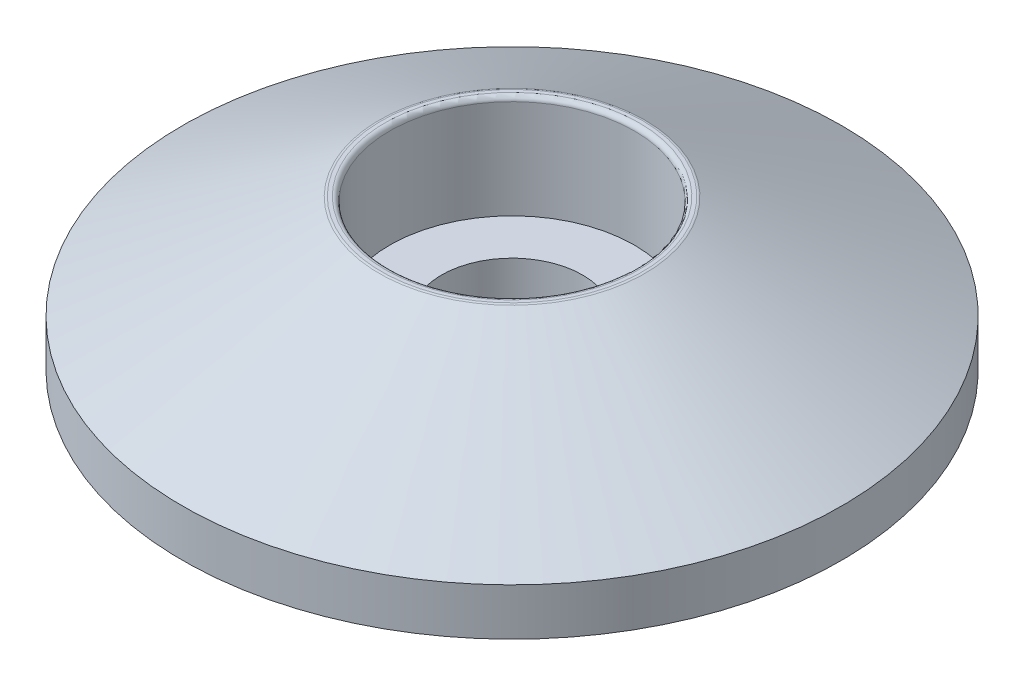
ISO-10303-21;
HEADER;
FILE_DESCRIPTION(('STEP AP214'),'2;1');
FILE_NAME('part.step','',(''),(''),'','','');
FILE_SCHEMA(('AUTOMOTIVE_DESIGN { 1 0 10303 214 1 1 1 1 }'));
ENDSEC;
DATA;
#1=APPLICATION_CONTEXT('core data for automotive mechanical design processes');
#2=APPLICATION_PROTOCOL_DEFINITION('international standard','automotive_design',2000,#1);
#3=PRODUCT_CONTEXT('',#1,'mechanical');
#4=PRODUCT('Part','Part','',(#3));
#5=PRODUCT_RELATED_PRODUCT_CATEGORY('part','',(#4));
#6=PRODUCT_DEFINITION_FORMATION('','',#4);
#7=PRODUCT_DEFINITION_CONTEXT('part definition',#1,'design');
#8=PRODUCT_DEFINITION('design','',#6,#7);
#9=PRODUCT_DEFINITION_SHAPE('','',#8);
#10=(LENGTH_UNIT() NAMED_UNIT(*) SI_UNIT(.MILLI.,.METRE.));
#11=(NAMED_UNIT(*) PLANE_ANGLE_UNIT() SI_UNIT($,.RADIAN.));
#12=(NAMED_UNIT(*) SI_UNIT($,.STERADIAN.) SOLID_ANGLE_UNIT());
#13=UNCERTAINTY_MEASURE_WITH_UNIT(LENGTH_MEASURE(1.E-05),#10,'distance_accuracy_value','');
#14=(GEOMETRIC_REPRESENTATION_CONTEXT(3) GLOBAL_UNCERTAINTY_ASSIGNED_CONTEXT((#13)) GLOBAL_UNIT_ASSIGNED_CONTEXT((#10,
#11,#12)) REPRESENTATION_CONTEXT('',''));
#15=CARTESIAN_POINT('',(0.,0.,0.));
#16=DIRECTION('',(0.,0.,1.));
#17=DIRECTION('',(1.,0.,0.));
#18=AXIS2_PLACEMENT_3D('',#15,#16,#17);
#19=CARTESIAN_POINT('',(0.,-13.0955737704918,0.));
#20=DIRECTION('',(0.,-1.,0.));
#21=DIRECTION('',(0.,0.,-1.));
#22=AXIS2_PLACEMENT_3D('',#19,#20,#21);
#23=CYLINDRICAL_SURFACE('',#22,7.);
#24=CARTESIAN_POINT('',(0.,1.,0.));
#25=DIRECTION('',(0.,-1.,0.));
#26=DIRECTION('',(0.,0.,-1.));
#27=AXIS2_PLACEMENT_3D('',#24,#25,#26);
#28=CIRCLE('',#27,7.);
#29=CARTESIAN_POINT('',(0.,1.,-7.));
#30=VERTEX_POINT('',#29);
#31=EDGE_CURVE('E55',#30,#30,#28,.T.);
#32=ORIENTED_EDGE('',*,*,#31,.T.);
#33=EDGE_LOOP('',(#32));
#34=FACE_BOUND('',#33,.T.);
#35=CARTESIAN_POINT('',(0.,0.,0.));
#36=DIRECTION('',(0.,-1.,0.));
#37=DIRECTION('',(0.,0.,-1.));
#38=AXIS2_PLACEMENT_3D('',#35,#36,#37);
#39=CIRCLE('',#38,7.);
#40=CARTESIAN_POINT('',(0.,0.,-7.));
#41=VERTEX_POINT('',#40);
#42=EDGE_CURVE('E10',#41,#41,#39,.T.);
#43=ORIENTED_EDGE('',*,*,#42,.F.);
#44=EDGE_LOOP('',(#43));
#45=FACE_BOUND('',#44,.T.);
#46=ADVANCED_FACE('F24',(#34,#45),#23,.T.);
#47=CARTESIAN_POINT('',(7.,0.,0.));
#48=DIRECTION('',(0.,-1.,0.));
#49=DIRECTION('',(0.,0.,-1.));
#50=AXIS2_PLACEMENT_3D('',#47,#48,#49);
#51=PLANE('',#50);
#52=ORIENTED_EDGE('',*,*,#42,.T.);
#53=EDGE_LOOP('',(#52));
#54=FACE_BOUND('',#53,.T.);
#55=CARTESIAN_POINT('',(0.,0.,0.));
#56=DIRECTION('',(0.,-1.,0.));
#57=DIRECTION('',(0.,0.,-1.));
#58=AXIS2_PLACEMENT_3D('',#55,#56,#57);
#59=CIRCLE('',#58,1.5);
#60=CARTESIAN_POINT('',(0.,0.,-1.5));
#61=VERTEX_POINT('',#60);
#62=EDGE_CURVE('E30',#61,#61,#59,.T.);
#63=ORIENTED_EDGE('',*,*,#62,.F.);
#64=EDGE_LOOP('',(#63));
#65=FACE_BOUND('',#64,.T.);
#66=ADVANCED_FACE('F73',(#54,#65),#51,.T.);
#67=CARTESIAN_POINT('',(0.,-13.0955737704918,0.));
#68=DIRECTION('',(0.,-1.,0.));
#69=DIRECTION('',(0.,0.,-1.));
#70=AXIS2_PLACEMENT_3D('',#67,#68,#69);
#71=CYLINDRICAL_SURFACE('',#70,1.5);
#72=ORIENTED_EDGE('',*,*,#62,.T.);
#73=EDGE_LOOP('',(#72));
#74=FACE_BOUND('',#73,.T.);
#75=CARTESIAN_POINT('',(0.,1.,0.));
#76=DIRECTION('',(0.,-1.,0.));
#77=DIRECTION('',(0.,0.,-1.));
#78=AXIS2_PLACEMENT_3D('',#75,#76,#77);
#79=CIRCLE('',#78,1.5);
#80=CARTESIAN_POINT('',(0.,1.,-1.5));
#81=VERTEX_POINT('',#80);
#82=EDGE_CURVE('E34',#81,#81,#79,.T.);
#83=ORIENTED_EDGE('',*,*,#82,.F.);
#84=EDGE_LOOP('',(#83));
#85=FACE_BOUND('',#84,.T.);
#86=ADVANCED_FACE('F77',(#74,#85),#71,.F.);
#87=CARTESIAN_POINT('',(1.5,1.,0.));
#88=DIRECTION('',(0.,1.,0.));
#89=DIRECTION('',(0.,0.,1.));
#90=AXIS2_PLACEMENT_3D('',#87,#88,#89);
#91=PLANE('',#90);
#92=ORIENTED_EDGE('',*,*,#82,.T.);
#93=EDGE_LOOP('',(#92));
#94=FACE_BOUND('',#93,.T.);
#95=CARTESIAN_POINT('',(0.,1.,0.));
#96=DIRECTION('',(0.,-1.,0.));
#97=DIRECTION('',(0.,0.,-1.));
#98=AXIS2_PLACEMENT_3D('',#95,#96,#97);
#99=CIRCLE('',#98,2.6);
#100=CARTESIAN_POINT('',(0.,1.,-2.6));
#101=VERTEX_POINT('',#100);
#102=EDGE_CURVE('E38',#101,#101,#99,.T.);
#103=ORIENTED_EDGE('',*,*,#102,.F.);
#104=EDGE_LOOP('',(#103));
#105=FACE_BOUND('',#104,.T.);
#106=ADVANCED_FACE('F81',(#94,#105),#91,.T.);
#107=CARTESIAN_POINT('',(0.,-13.0955737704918,0.));
#108=DIRECTION('',(0.,-1.,0.));
#109=DIRECTION('',(0.,0.,-1.));
#110=AXIS2_PLACEMENT_3D('',#107,#108,#109);
#111=CYLINDRICAL_SURFACE('',#110,2.6);
#112=ORIENTED_EDGE('',*,*,#102,.T.);
#113=EDGE_LOOP('',(#112));
#114=FACE_BOUND('',#113,.T.);
#115=CARTESIAN_POINT('',(0.,3.1,0.));
#116=DIRECTION('',(0.,-1.,0.));
#117=DIRECTION('',(0.,0.,-1.));
#118=AXIS2_PLACEMENT_3D('',#115,#116,#117);
#119=CIRCLE('',#118,2.6);
#120=CARTESIAN_POINT('',(0.,3.1,-2.6));
#121=VERTEX_POINT('',#120);
#122=EDGE_CURVE('E43',#121,#121,#119,.T.);
#123=ORIENTED_EDGE('',*,*,#122,.F.);
#124=EDGE_LOOP('',(#123));
#125=FACE_BOUND('',#124,.T.);
#126=ADVANCED_FACE('F87',(#114,#125),#111,.F.);
#127=CARTESIAN_POINT('',(0.,3.1,0.));
#128=DIRECTION('',(0.,-1.,0.));
#129=DIRECTION('',(0.,0.,-1.));
#130=AXIS2_PLACEMENT_3D('',#127,#128,#129);
#131=TOROIDAL_SURFACE('',#130,2.7,0.0999999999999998);
#132=ORIENTED_EDGE('',*,*,#122,.T.);
#133=EDGE_LOOP('',(#132));
#134=FACE_BOUND('',#133,.T.);
#135=CARTESIAN_POINT('',(0.,3.2,0.));
#136=DIRECTION('',(0.,-1.,0.));
#137=DIRECTION('',(0.,0.,-1.));
#138=AXIS2_PLACEMENT_3D('',#135,#136,#137);
#139=CIRCLE('',#138,2.7);
#140=CARTESIAN_POINT('',(0.,3.2,-2.7));
#141=VERTEX_POINT('',#140);
#142=EDGE_CURVE('E46',#141,#141,#139,.T.);
#143=ORIENTED_EDGE('',*,*,#142,.F.);
#144=EDGE_LOOP('',(#143));
#145=FACE_BOUND('',#144,.T.);
#146=ADVANCED_FACE('F91',(#134,#145),#131,.T.);
#147=CARTESIAN_POINT('',(2.7,3.2,0.));
#148=DIRECTION('',(0.,1.,0.));
#149=DIRECTION('',(0.,0.,1.));
#150=AXIS2_PLACEMENT_3D('',#147,#148,#149);
#151=PLANE('',#150);
#152=ORIENTED_EDGE('',*,*,#142,.T.);
#153=EDGE_LOOP('',(#152));
#154=FACE_BOUND('',#153,.T.);
#155=CARTESIAN_POINT('',(0.,3.2,0.));
#156=DIRECTION('',(0.,-1.,0.));
#157=DIRECTION('',(0.,0.,-1.));
#158=AXIS2_PLACEMENT_3D('',#155,#156,#157);
#159=CIRCLE('',#158,2.7753950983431);
#160=CARTESIAN_POINT('',(0.,3.2,-2.7753950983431));
#161=VERTEX_POINT('',#160);
#162=EDGE_CURVE('E49',#161,#161,#159,.T.);
#163=ORIENTED_EDGE('',*,*,#162,.F.);
#164=EDGE_LOOP('',(#163));
#165=FACE_BOUND('',#164,.T.);
#166=ADVANCED_FACE('F69',(#154,#165),#151,.T.);
#167=CARTESIAN_POINT('',(0.,3.1,0.));
#168=DIRECTION('',(0.,-1.,0.));
#169=DIRECTION('',(0.,0.,-1.));
#170=AXIS2_PLACEMENT_3D('',#167,#168,#169);
#171=TOROIDAL_SURFACE('',#170,2.7753950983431,0.0999999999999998);
#172=ORIENTED_EDGE('',*,*,#162,.T.);
#173=EDGE_LOOP('',(#172));
#174=FACE_BOUND('',#173,.T.);
#175=CARTESIAN_POINT('',(0.,3.18858315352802,0.));
#176=DIRECTION('',(0.,-1.,0.));
#177=DIRECTION('',(0.,0.,-1.));
#178=AXIS2_PLACEMENT_3D('',#175,#176,#177);
#179=CIRCLE('',#178,2.82179579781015);
#180=CARTESIAN_POINT('',(0.,3.18858315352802,-2.82179579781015));
#181=VERTEX_POINT('',#180);
#182=EDGE_CURVE('E52',#181,#181,#179,.T.);
#183=ORIENTED_EDGE('',*,*,#182,.F.);
#184=EDGE_LOOP('',(#183));
#185=FACE_BOUND('',#184,.T.);
#186=ADVANCED_FACE('F63',(#174,#185),#171,.T.);
#187=CARTESIAN_POINT('',(0.,1.,0.));
#188=DIRECTION('',(0.,-1.,0.));
#189=DIRECTION('',(0.,0.,-1.));
#190=AXIS2_PLACEMENT_3D('',#187,#188,#189);
#191=CONICAL_SURFACE('',#190,7.,1.08828303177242);
#192=ORIENTED_EDGE('',*,*,#182,.T.);
#193=EDGE_LOOP('',(#192));
#194=FACE_BOUND('',#193,.T.);
#195=ORIENTED_EDGE('',*,*,#31,.F.);
#196=EDGE_LOOP('',(#195));
#197=FACE_BOUND('',#196,.T.);
#198=ADVANCED_FACE('F61',(#194,#197),#191,.T.);
#199=CLOSED_SHELL('',(#46,#66,#86,#106,#126,#146,#166,#186,#198));
#200=MANIFOLD_SOLID_BREP('B2',#199);
#201=ADVANCED_BREP_SHAPE_REPRESENTATION('',(#18,#200),#14);
#202=SHAPE_DEFINITION_REPRESENTATION(#9,#201);
ENDSEC;
END-ISO-10303-21;
